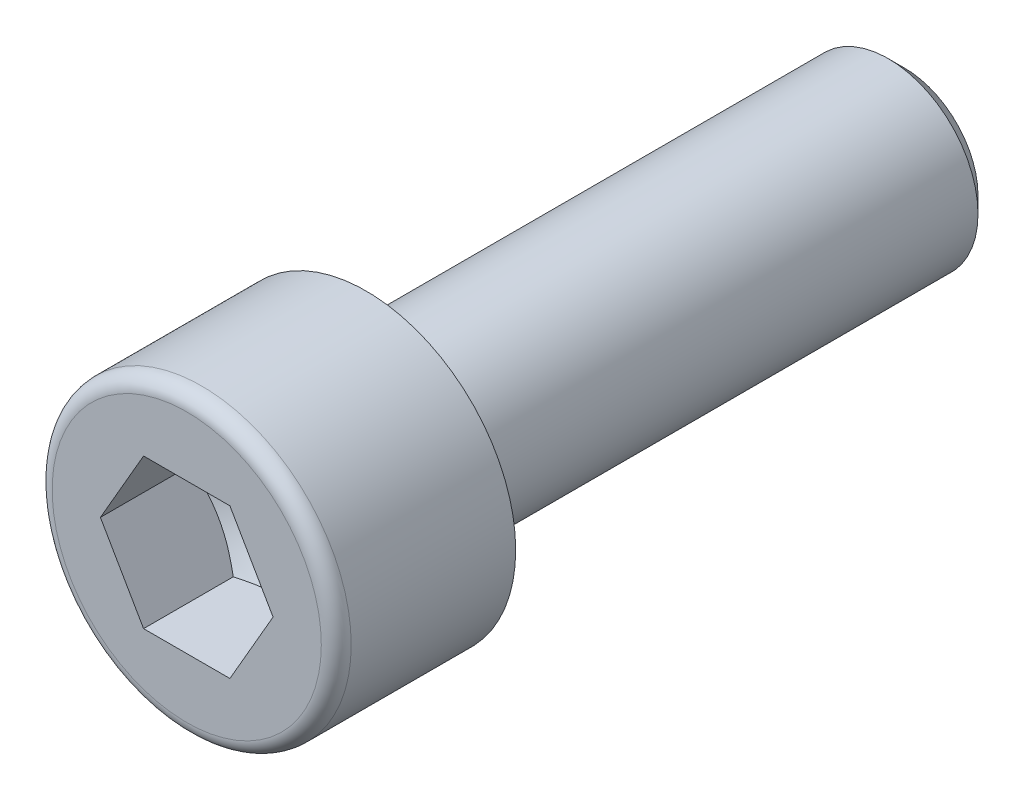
ISO-10303-21;
HEADER;
FILE_DESCRIPTION(('STEP AP214'),'2;1');
FILE_NAME('part.step','',(''),(''),'','','');
FILE_SCHEMA(('AUTOMOTIVE_DESIGN { 1 0 10303 214 1 1 1 1 }'));
ENDSEC;
DATA;
#1=APPLICATION_CONTEXT('core data for automotive mechanical design processes');
#2=APPLICATION_PROTOCOL_DEFINITION('international standard','automotive_design',2000,#1);
#3=PRODUCT_CONTEXT('',#1,'mechanical');
#4=PRODUCT('Part','Part','',(#3));
#5=PRODUCT_RELATED_PRODUCT_CATEGORY('part','',(#4));
#6=PRODUCT_DEFINITION_FORMATION('','',#4);
#7=PRODUCT_DEFINITION_CONTEXT('part definition',#1,'design');
#8=PRODUCT_DEFINITION('design','',#6,#7);
#9=PRODUCT_DEFINITION_SHAPE('','',#8);
#10=(LENGTH_UNIT() NAMED_UNIT(*) SI_UNIT(.MILLI.,.METRE.));
#11=(NAMED_UNIT(*) PLANE_ANGLE_UNIT() SI_UNIT($,.RADIAN.));
#12=(NAMED_UNIT(*) SI_UNIT($,.STERADIAN.) SOLID_ANGLE_UNIT());
#13=UNCERTAINTY_MEASURE_WITH_UNIT(LENGTH_MEASURE(1.E-05),#10,'distance_accuracy_value','');
#14=(GEOMETRIC_REPRESENTATION_CONTEXT(3) GLOBAL_UNCERTAINTY_ASSIGNED_CONTEXT((#13)) GLOBAL_UNIT_ASSIGNED_CONTEXT((#10,
#11,#12)) REPRESENTATION_CONTEXT('',''));
#15=CARTESIAN_POINT('',(0.,0.,0.));
#16=DIRECTION('',(0.,0.,1.));
#17=DIRECTION('',(1.,0.,0.));
#18=AXIS2_PLACEMENT_3D('',#15,#16,#17);
#19=CARTESIAN_POINT('',(6.10622663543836E-13,5.55111512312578E-13,6.));
#20=DIRECTION('',(0.,0.,1.));
#21=DIRECTION('',(1.00000000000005,0.,0.));
#22=AXIS2_PLACEMENT_3D('',#19,#20,#21);
#23=PLANE('',#22);
#24=CARTESIAN_POINT('',(6.10622663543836E-13,5.55111512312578E-13,6.));
#25=DIRECTION('',(0.,0.,1.));
#26=DIRECTION('',(1.00000000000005,0.,0.));
#27=AXIS2_PLACEMENT_3D('',#24,#25,#26);
#28=CIRCLE('',#27,4.5);
#29=CARTESIAN_POINT('',(4.50000000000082,6.41292574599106E-13,6.));
#30=VERTEX_POINT('',#29);
#31=EDGE_CURVE('E13',#30,#30,#28,.T.);
#32=ORIENTED_EDGE('',*,*,#31,.T.);
#33=EDGE_LOOP('',(#32));
#34=FACE_BOUND('',#33,.T.);
#35=DIRECTION('',(1.00000000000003,0.,0.));
#36=VECTOR('',#35,1.);
#37=CARTESIAN_POINT('',(-1.44337499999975,2.49999883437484,6.00000000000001));
#38=LINE('',#37,#36);
#39=CARTESIAN_POINT('',(-1.44337499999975,2.49999883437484,6.00000000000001));
#40=VERTEX_POINT('',#39);
#41=CARTESIAN_POINT('',(1.44337500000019,2.499998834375,6.));
#42=VERTEX_POINT('',#41);
#43=EDGE_CURVE('E100',#40,#42,#38,.T.);
#44=ORIENTED_EDGE('',*,*,#43,.T.);
#45=DIRECTION('',(0.5,-0.866025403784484,0.));
#46=VECTOR('',#45,1.);
#47=CARTESIAN_POINT('',(1.44337500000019,2.499998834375,6.));
#48=LINE('',#47,#46);
#49=CARTESIAN_POINT('',(2.88674999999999,0.,5.99999999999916));
#50=VERTEX_POINT('',#49);
#51=EDGE_CURVE('E39',#42,#50,#48,.T.);
#52=ORIENTED_EDGE('',*,*,#51,.T.);
#53=DIRECTION('',(-0.500000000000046,-0.866025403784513,0.));
#54=VECTOR('',#53,1.);
#55=CARTESIAN_POINT('',(2.88674999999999,0.,5.99999999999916));
#56=LINE('',#55,#54);
#57=CARTESIAN_POINT('',(1.44337500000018,-2.49999883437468,5.99999999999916));
#58=VERTEX_POINT('',#57);
#59=EDGE_CURVE('E177',#50,#58,#56,.T.);
#60=ORIENTED_EDGE('',*,*,#59,.T.);
#61=DIRECTION('',(-1.00000000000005,0.,0.));
#62=VECTOR('',#61,1.);
#63=CARTESIAN_POINT('',(1.44337500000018,-2.49999883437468,5.99999999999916));
#64=LINE('',#63,#62);
#65=CARTESIAN_POINT('',(-1.44337499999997,-2.49999883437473,6.));
#66=VERTEX_POINT('',#65);
#67=EDGE_CURVE('E173',#58,#66,#64,.T.);
#68=ORIENTED_EDGE('',*,*,#67,.T.);
#69=DIRECTION('',(-0.5,0.866025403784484,0.));
#70=VECTOR('',#69,1.);
#71=CARTESIAN_POINT('',(-1.44337499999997,-2.49999883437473,6.));
#72=LINE('',#71,#70);
#73=CARTESIAN_POINT('',(-2.88674999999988,1.11022302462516E-13,6.));
#74=VERTEX_POINT('',#73);
#75=EDGE_CURVE('E168',#66,#74,#72,.T.);
#76=ORIENTED_EDGE('',*,*,#75,.T.);
#77=DIRECTION('',(0.500000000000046,0.866025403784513,0.));
#78=VECTOR('',#77,1.);
#79=CARTESIAN_POINT('',(-2.88674999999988,1.11022302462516E-13,6.));
#80=LINE('',#79,#78);
#81=EDGE_CURVE('E104',#74,#40,#80,.T.);
#82=ORIENTED_EDGE('',*,*,#81,.T.);
#83=EDGE_LOOP('',(#44,#52,#60,#68,#76,#82));
#84=FACE_BOUND('',#83,.T.);
#85=ADVANCED_FACE('F25',(#34,#84),#23,.T.);
#86=CARTESIAN_POINT('',(0.,1.11022302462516E-13,5.5));
#87=DIRECTION('',(0.,0.,1.));
#88=DIRECTION('',(1.00000000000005,0.,0.));
#89=AXIS2_PLACEMENT_3D('',#86,#87,#88);
#90=TOROIDAL_SURFACE('',#89,4.5,0.5);
#91=ORIENTED_EDGE('',*,*,#31,.F.);
#92=EDGE_LOOP('',(#91));
#93=FACE_BOUND('',#92,.T.);
#94=CARTESIAN_POINT('',(0.,1.11022302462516E-13,5.5));
#95=DIRECTION('',(0.,0.,1.));
#96=DIRECTION('',(1.00000000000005,0.,0.));
#97=AXIS2_PLACEMENT_3D('',#94,#95,#96);
#98=CIRCLE('',#97,5.);
#99=CARTESIAN_POINT('',(5.00000000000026,2.06779038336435E-13,5.5));
#100=VERTEX_POINT('',#99);
#101=EDGE_CURVE('E32',#100,#100,#98,.T.);
#102=ORIENTED_EDGE('',*,*,#101,.T.);
#103=EDGE_LOOP('',(#102));
#104=FACE_BOUND('',#103,.T.);
#105=ADVANCED_FACE('F141',(#93,#104),#90,.T.);
#106=CARTESIAN_POINT('',(6.10622663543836E-13,5.55111512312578E-13,6.));
#107=DIRECTION('',(0.,0.,1.));
#108=DIRECTION('',(1.00000000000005,0.,0.));
#109=AXIS2_PLACEMENT_3D('',#106,#107,#108);
#110=CYLINDRICAL_SURFACE('',#109,5.);
#111=CARTESIAN_POINT('',(0.,0.,0.));
#112=DIRECTION('',(0.,0.,1.));
#113=DIRECTION('',(1.00000000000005,0.,0.));
#114=AXIS2_PLACEMENT_3D('',#111,#112,#113);
#115=CIRCLE('',#114,5.);
#116=CARTESIAN_POINT('',(5.00000000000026,0.,0.));
#117=VERTEX_POINT('',#116);
#118=EDGE_CURVE('E136',#117,#117,#115,.T.);
#119=ORIENTED_EDGE('',*,*,#118,.T.);
#120=EDGE_LOOP('',(#119));
#121=FACE_BOUND('',#120,.T.);
#122=ORIENTED_EDGE('',*,*,#101,.F.);
#123=EDGE_LOOP('',(#122));
#124=FACE_BOUND('',#123,.T.);
#125=ADVANCED_FACE('F143',(#121,#124),#110,.T.);
#126=CARTESIAN_POINT('',(0.,5.,0.));
#127=DIRECTION('',(0.,0.,-1.));
#128=DIRECTION('',(-1.00000000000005,0.,0.));
#129=AXIS2_PLACEMENT_3D('',#126,#127,#128);
#130=PLANE('',#129);
#131=CARTESIAN_POINT('',(0.,0.,0.));
#132=DIRECTION('',(0.,0.,1.));
#133=DIRECTION('',(1.00000000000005,0.,0.));
#134=AXIS2_PLACEMENT_3D('',#131,#132,#133);
#135=CIRCLE('',#134,3.3);
#136=CARTESIAN_POINT('',(3.30000000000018,0.,0.));
#137=VERTEX_POINT('',#136);
#138=EDGE_CURVE('E133',#137,#137,#135,.T.);
#139=ORIENTED_EDGE('',*,*,#138,.T.);
#140=EDGE_LOOP('',(#139));
#141=FACE_BOUND('',#140,.T.);
#142=ORIENTED_EDGE('',*,*,#118,.F.);
#143=EDGE_LOOP('',(#142));
#144=FACE_BOUND('',#143,.T.);
#145=ADVANCED_FACE('F145',(#141,#144),#130,.T.);
#146=CARTESIAN_POINT('',(0.,0.,-0.300000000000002));
#147=DIRECTION('',(0.,0.,1.));
#148=DIRECTION('',(1.00000000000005,0.,0.));
#149=AXIS2_PLACEMENT_3D('',#146,#147,#148);
#150=TOROIDAL_SURFACE('',#149,3.3,0.3);
#151=CARTESIAN_POINT('',(0.,0.,-0.300000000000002));
#152=DIRECTION('',(0.,0.,1.));
#153=DIRECTION('',(1.00000000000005,0.,0.));
#154=AXIS2_PLACEMENT_3D('',#151,#152,#153);
#155=CIRCLE('',#154,3.);
#156=CARTESIAN_POINT('',(3.00000000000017,0.,-0.300000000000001));
#157=VERTEX_POINT('',#156);
#158=EDGE_CURVE('E130',#157,#157,#155,.T.);
#159=ORIENTED_EDGE('',*,*,#158,.T.);
#160=EDGE_LOOP('',(#159));
#161=FACE_BOUND('',#160,.T.);
#162=ORIENTED_EDGE('',*,*,#138,.F.);
#163=EDGE_LOOP('',(#162));
#164=FACE_BOUND('',#163,.T.);
#165=ADVANCED_FACE('F153',(#161,#164),#150,.F.);
#166=CARTESIAN_POINT('',(6.10622663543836E-13,5.55111512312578E-13,6.));
#167=DIRECTION('',(0.,0.,1.));
#168=DIRECTION('',(1.00000000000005,0.,0.));
#169=AXIS2_PLACEMENT_3D('',#166,#167,#168);
#170=CYLINDRICAL_SURFACE('',#169,3.);
#171=CARTESIAN_POINT('',(0.,0.,-0.301000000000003));
#172=DIRECTION('',(0.,0.,1.));
#173=DIRECTION('',(1.00000000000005,0.,0.));
#174=AXIS2_PLACEMENT_3D('',#171,#172,#173);
#175=CIRCLE('',#174,3.);
#176=CARTESIAN_POINT('',(3.00000000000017,0.,-0.301000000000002));
#177=VERTEX_POINT('',#176);
#178=EDGE_CURVE('E127',#177,#177,#175,.T.);
#179=ORIENTED_EDGE('',*,*,#178,.T.);
#180=EDGE_LOOP('',(#179));
#181=FACE_BOUND('',#180,.T.);
#182=ORIENTED_EDGE('',*,*,#158,.F.);
#183=EDGE_LOOP('',(#182));
#184=FACE_BOUND('',#183,.T.);
#185=ADVANCED_FACE('F276',(#181,#184),#170,.T.);
#186=CARTESIAN_POINT('',(0.,0.,-0.301000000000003));
#187=DIRECTION('',(0.,0.,1.));
#188=DIRECTION('',(1.00000000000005,0.,0.));
#189=AXIS2_PLACEMENT_3D('',#186,#187,#188);
#190=CONICAL_SURFACE('',#189,3.,0.523598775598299);
#191=CARTESIAN_POINT('',(3.05311331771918E-13,0.,-1.23847249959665));
#192=DIRECTION('',(0.,0.,1.));
#193=DIRECTION('',(1.00000000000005,0.,0.));
#194=AXIS2_PLACEMENT_3D('',#191,#192,#193);
#195=CIRCLE('',#194,2.45875);
#196=CARTESIAN_POINT('',(2.45875000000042,0.,-1.23847249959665));
#197=VERTEX_POINT('',#196);
#198=EDGE_CURVE('E124',#197,#197,#195,.T.);
#199=ORIENTED_EDGE('',*,*,#198,.T.);
#200=EDGE_LOOP('',(#199));
#201=FACE_BOUND('',#200,.T.);
#202=ORIENTED_EDGE('',*,*,#178,.F.);
#203=EDGE_LOOP('',(#202));
#204=FACE_BOUND('',#203,.T.);
#205=ADVANCED_FACE('F272',(#201,#204),#190,.T.);
#206=CARTESIAN_POINT('',(3.05311331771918E-13,2.45875000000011,-1.23847249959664));
#207=DIRECTION('',(0.,0.,1.));
#208=DIRECTION('',(1.00000000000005,0.,0.));
#209=AXIS2_PLACEMENT_3D('',#206,#207,#208);
#210=PLANE('',#209);
#211=CARTESIAN_POINT('',(3.05311331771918E-13,0.,-1.23847249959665));
#212=DIRECTION('',(0.,0.,1.));
#213=DIRECTION('',(1.00000000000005,0.,0.));
#214=AXIS2_PLACEMENT_3D('',#211,#212,#213);
#215=CIRCLE('',#214,3.);
#216=CARTESIAN_POINT('',(3.00000000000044,0.,-1.23847249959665));
#217=VERTEX_POINT('',#216);
#218=EDGE_CURVE('E121',#217,#217,#215,.T.);
#219=ORIENTED_EDGE('',*,*,#218,.T.);
#220=EDGE_LOOP('',(#219));
#221=FACE_BOUND('',#220,.T.);
#222=ORIENTED_EDGE('',*,*,#198,.F.);
#223=EDGE_LOOP('',(#222));
#224=FACE_BOUND('',#223,.T.);
#225=ADVANCED_FACE('F268',(#221,#224),#210,.T.);
#226=CARTESIAN_POINT('',(6.10622663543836E-13,5.55111512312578E-13,6.));
#227=DIRECTION('',(0.,0.,1.));
#228=DIRECTION('',(1.00000000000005,0.,0.));
#229=AXIS2_PLACEMENT_3D('',#226,#227,#228);
#230=CYLINDRICAL_SURFACE('',#229,3.);
#231=CARTESIAN_POINT('',(5.82867087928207E-13,0.,-17.45875));
#232=DIRECTION('',(0.,0.,1.));
#233=DIRECTION('',(1.00000000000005,0.,0.));
#234=AXIS2_PLACEMENT_3D('',#231,#232,#233);
#235=CIRCLE('',#234,3.);
#236=CARTESIAN_POINT('',(3.00000000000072,0.,-17.45875));
#237=VERTEX_POINT('',#236);
#238=EDGE_CURVE('E118',#237,#237,#235,.T.);
#239=ORIENTED_EDGE('',*,*,#238,.T.);
#240=EDGE_LOOP('',(#239));
#241=FACE_BOUND('',#240,.T.);
#242=ORIENTED_EDGE('',*,*,#218,.F.);
#243=EDGE_LOOP('',(#242));
#244=FACE_BOUND('',#243,.T.);
#245=ADVANCED_FACE('F261',(#241,#244),#230,.T.);
#246=CARTESIAN_POINT('',(5.82867087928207E-13,0.,-17.45875));
#247=DIRECTION('',(0.,0.,1.));
#248=DIRECTION('',(1.00000000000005,0.,0.));
#249=AXIS2_PLACEMENT_3D('',#246,#247,#248);
#250=CONICAL_SURFACE('',#249,3.,0.78539816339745);
#251=CARTESIAN_POINT('',(3.60822483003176E-13,0.,-18.));
#252=DIRECTION('',(0.,0.,1.));
#253=DIRECTION('',(1.00000000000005,0.,0.));
#254=AXIS2_PLACEMENT_3D('',#251,#252,#253);
#255=CIRCLE('',#254,2.45875);
#256=CARTESIAN_POINT('',(2.45875000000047,0.,-18.));
#257=VERTEX_POINT('',#256);
#258=EDGE_CURVE('E115',#257,#257,#255,.T.);
#259=ORIENTED_EDGE('',*,*,#258,.T.);
#260=EDGE_LOOP('',(#259));
#261=FACE_BOUND('',#260,.T.);
#262=ORIENTED_EDGE('',*,*,#238,.F.);
#263=EDGE_LOOP('',(#262));
#264=FACE_BOUND('',#263,.T.);
#265=ADVANCED_FACE('F256',(#261,#264),#250,.T.);
#266=CARTESIAN_POINT('',(3.60822483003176E-13,2.4587500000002,-18.));
#267=DIRECTION('',(0.,0.,-1.));
#268=DIRECTION('',(-1.00000000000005,0.,0.));
#269=AXIS2_PLACEMENT_3D('',#266,#267,#268);
#270=PLANE('',#269);
#271=ORIENTED_EDGE('',*,*,#258,.F.);
#272=EDGE_LOOP('',(#271));
#273=FACE_BOUND('',#272,.T.);
#274=ADVANCED_FACE('F233',(#273),#270,.T.);
#275=CARTESIAN_POINT('',(1.4433750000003,2.49999883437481,1.33333411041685));
#276=DIRECTION('',(-0.866025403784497,-0.500000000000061,0.));
#277=DIRECTION('',(-0.5,0.866025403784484,0.));
#278=AXIS2_PLACEMENT_3D('',#275,#276,#277);
#279=PLANE('',#278);
#280=DIRECTION('',(0.,0.,1.));
#281=VECTOR('',#280,1.);
#282=CARTESIAN_POINT('',(2.88675000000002,0.,1.333334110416));
#283=LINE('',#282,#281);
#284=CARTESIAN_POINT('',(2.88675000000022,1.66533453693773E-13,2.99999999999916));
#285=VERTEX_POINT('',#284);
#286=EDGE_CURVE('E113',#285,#50,#283,.T.);
#287=ORIENTED_EDGE('',*,*,#286,.T.);
#288=ORIENTED_EDGE('',*,*,#51,.F.);
#289=DIRECTION('',(0.,0.,1.));
#290=VECTOR('',#289,1.);
#291=CARTESIAN_POINT('',(1.4433750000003,2.49999883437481,1.33333411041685));
#292=LINE('',#291,#290);
#293=CARTESIAN_POINT('',(1.44337500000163,2.49999883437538,3.));
#294=VERTEX_POINT('',#293);
#295=EDGE_CURVE('E94',#294,#42,#292,.T.);
#296=ORIENTED_EDGE('',*,*,#295,.F.);
#297=CARTESIAN_POINT('',(2.88675011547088,-1.99999558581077E-07,3.00000006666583));
#298=CARTESIAN_POINT('',(2.82332252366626,0.109859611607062,2.96336950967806));
#299=CARTESIAN_POINT('',(2.75934742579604,0.220667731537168,2.93005593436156));
#300=CARTESIAN_POINT('',(2.63028954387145,0.444202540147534,2.87190808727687));
#301=CARTESIAN_POINT('',(2.56520446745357,0.556933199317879,2.84709438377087));
#302=CARTESIAN_POINT('',(2.43584088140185,0.780997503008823,2.80847006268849));
#303=CARTESIAN_POINT('',(2.37158227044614,0.892296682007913,2.7944023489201));
#304=CARTESIAN_POINT('',(2.24276284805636,1.1154184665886,2.77761157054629));
#305=CARTESIAN_POINT('',(2.17820250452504,1.22724026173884,2.77487459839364));
#306=CARTESIAN_POINT('',(2.05757841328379,1.43616731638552,2.78058295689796));
#307=CARTESIAN_POINT('',(2.00149656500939,1.53330392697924,2.78762669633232));
#308=CARTESIAN_POINT('',(1.88969822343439,1.72694433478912,2.8099467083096));
#309=CARTESIAN_POINT('',(1.83398211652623,1.82344746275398,2.8252305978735));
#310=CARTESIAN_POINT('',(1.7219534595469,2.01748678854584,2.86343736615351));
#311=CARTESIAN_POINT('',(1.6656550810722,2.11499844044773,2.88652212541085));
#312=CARTESIAN_POINT('',(1.55389777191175,2.3085677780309,2.93891477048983));
#313=CARTESIAN_POINT('',(1.4984374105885,2.40462794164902,2.96821035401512));
#314=CARTESIAN_POINT('',(1.44337488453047,2.49999903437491,3.00000006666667));
#315=B_SPLINE_CURVE_WITH_KNOTS('',3,(#297,#298,#299,#300,#301,#302,#303,#304,#305,#306,#307,
#308,#309,#310,#311,#312,#313,#314),.UNSPECIFIED.,.F.,.F.,(4,2,2,2,2,2,2,2,4),(0.,
0.396269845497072,0.793491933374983,1.18088400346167,1.56780044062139,1.90463400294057,
2.24177946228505,2.58640119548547,2.93034658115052),.UNSPECIFIED.);
#316=EDGE_CURVE('E87',#285,#294,#315,.T.);
#317=ORIENTED_EDGE('',*,*,#316,.F.);
#318=EDGE_LOOP('',(#287,#288,#296,#317));
#319=FACE_BOUND('',#318,.T.);
#320=ADVANCED_FACE('F95',(#319),#279,.T.);
#321=CARTESIAN_POINT('',(2.88675000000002,0.,1.333334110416));
#322=DIRECTION('',(-0.866025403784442,0.500000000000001,0.));
#323=DIRECTION('',(0.500000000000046,0.866025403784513,0.));
#324=AXIS2_PLACEMENT_3D('',#321,#322,#323);
#325=PLANE('',#324);
#326=DIRECTION('',(0.,0.,1.));
#327=VECTOR('',#326,1.);
#328=CARTESIAN_POINT('',(1.44337500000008,-2.49999883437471,1.333334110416));
#329=LINE('',#328,#327);
#330=CARTESIAN_POINT('',(1.44337500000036,-2.4999988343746,2.99999999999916));
#331=VERTEX_POINT('',#330);
#332=EDGE_CURVE('E111',#331,#58,#329,.T.);
#333=ORIENTED_EDGE('',*,*,#332,.T.);
#334=ORIENTED_EDGE('',*,*,#59,.F.);
#335=ORIENTED_EDGE('',*,*,#286,.F.);
#336=CARTESIAN_POINT('',(1.44337488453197,-2.49999903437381,3.00000006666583));
#337=CARTESIAN_POINT('',(1.50680247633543,-2.39013922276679,2.96336950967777));
#338=CARTESIAN_POINT('',(1.57077757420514,-2.27933110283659,2.93005593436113));
#339=CARTESIAN_POINT('',(1.69983545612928,-2.05579629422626,2.87190808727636));
#340=CARTESIAN_POINT('',(1.76492053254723,-1.94306563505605,2.84709438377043));
#341=CARTESIAN_POINT('',(1.89428411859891,-1.71900133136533,2.80847006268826));
#342=CARTESIAN_POINT('',(1.95854272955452,-1.60770215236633,2.79440234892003));
#343=CARTESIAN_POINT('',(2.08736215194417,-1.38458036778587,2.77761157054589));
#344=CARTESIAN_POINT('',(2.15192249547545,-1.27275857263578,2.77487459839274));
#345=CARTESIAN_POINT('',(2.27254658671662,-1.06383151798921,2.78058295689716));
#346=CARTESIAN_POINT('',(2.328628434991,-0.966694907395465,2.78762669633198));
#347=CARTESIAN_POINT('',(2.44042677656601,-0.773054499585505,2.80994670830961));
#348=CARTESIAN_POINT('',(2.49614288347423,-0.676551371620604,2.82523059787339));
#349=CARTESIAN_POINT('',(2.60817154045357,-0.482512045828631,2.86343736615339));
#350=CARTESIAN_POINT('',(2.66446991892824,-0.38500039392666,2.88652212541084));
#351=CARTESIAN_POINT('',(2.77622722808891,-0.191431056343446,2.93891477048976));
#352=CARTESIAN_POINT('',(2.83168758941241,-0.0953708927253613,2.96821035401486));
#353=CARTESIAN_POINT('',(2.88675011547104,2.00000391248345E-07,3.00000006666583));
#354=B_SPLINE_CURVE_WITH_KNOTS('',3,(#336,#337,#338,#339,#340,#341,#342,#343,#344,#345,#346,
#347,#348,#349,#350,#351,#352,#353),.UNSPECIFIED.,.F.,.F.,(4,2,2,2,2,2,2,2,4),(0.,
0.396269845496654,0.793491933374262,1.18088400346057,1.56780044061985,1.90463400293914,
2.24177946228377,2.58640119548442,2.93034658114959),.UNSPECIFIED.);
#355=EDGE_CURVE('E91',#331,#285,#354,.T.);
#356=ORIENTED_EDGE('',*,*,#355,.F.);
#357=EDGE_LOOP('',(#333,#334,#335,#356));
#358=FACE_BOUND('',#357,.T.);
#359=ADVANCED_FACE('F224',(#358),#325,.T.);
#360=CARTESIAN_POINT('',(1.44337500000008,-2.49999883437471,1.333334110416));
#361=DIRECTION('',(0.,1.00000000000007,0.));
#362=DIRECTION('',(1.00000000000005,0.,0.));
#363=AXIS2_PLACEMENT_3D('',#360,#361,#362);
#364=PLANE('',#363);
#365=DIRECTION('',(0.,0.,1.));
#366=VECTOR('',#365,1.);
#367=CARTESIAN_POINT('',(-1.443375,-2.49999883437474,1.33333411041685));
#368=LINE('',#367,#366);
#369=CARTESIAN_POINT('',(-1.44337499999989,-2.4999988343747,3.));
#370=VERTEX_POINT('',#369);
#371=EDGE_CURVE('E109',#370,#66,#368,.T.);
#372=ORIENTED_EDGE('',*,*,#371,.T.);
#373=ORIENTED_EDGE('',*,*,#67,.F.);
#374=ORIENTED_EDGE('',*,*,#332,.F.);
#375=CARTESIAN_POINT('',(-3.73786106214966,-2.49999883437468,3.92958778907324));
#376=CARTESIAN_POINT('',(-3.62990250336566,-2.49999883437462,3.87779335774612));
#377=CARTESIAN_POINT('',(-3.52168094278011,-2.49999883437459,3.82653690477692));
#378=CARTESIAN_POINT('',(-3.30457164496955,-2.49999883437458,3.72540514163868));
#379=CARTESIAN_POINT('',(-3.19568379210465,-2.49999883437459,3.67553008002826));
#380=CARTESIAN_POINT('',(-2.97647740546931,-2.4999988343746,3.57718765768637));
#381=CARTESIAN_POINT('',(-2.8661541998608,-2.4999988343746,3.5287306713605));
#382=CARTESIAN_POINT('',(-2.64458202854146,-2.4999988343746,3.43398963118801));
#383=CARTESIAN_POINT('',(-2.53333311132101,-2.49999883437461,3.38770546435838));
#384=CARTESIAN_POINT('',(-2.30680205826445,-2.49999883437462,3.29671007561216));
#385=CARTESIAN_POINT('',(-2.19149052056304,-2.49999883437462,3.25207161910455));
#386=CARTESIAN_POINT('',(-1.95947266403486,-2.49999883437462,3.16650598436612));
#387=CARTESIAN_POINT('',(-1.84276618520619,-2.49999883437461,3.12557923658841));
#388=CARTESIAN_POINT('',(-1.60804233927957,-2.49999883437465,3.04860739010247));
#389=CARTESIAN_POINT('',(-1.49002871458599,-2.49999883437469,3.01255100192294));
#390=CARTESIAN_POINT('',(-1.252310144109,-2.49999883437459,2.94655294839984));
#391=CARTESIAN_POINT('',(-1.13260562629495,-2.49999883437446,2.91660976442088));
#392=CARTESIAN_POINT('',(-0.891754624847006,-2.49999883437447,2.8644343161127));
#393=CARTESIAN_POINT('',(-0.770611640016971,-2.49999883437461,2.84218621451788));
#394=CARTESIAN_POINT('',(-0.526970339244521,-2.4999988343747,2.80685777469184));
#395=CARTESIAN_POINT('',(-0.40447211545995,-2.49999883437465,2.79377681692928));
#396=CARTESIAN_POINT('',(-0.160266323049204,-2.49999883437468,2.7779963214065));
#397=CARTESIAN_POINT('',(-0.0385668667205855,-2.49999883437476,2.77517427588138));
#398=CARTESIAN_POINT('',(0.204641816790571,-2.4999988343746,2.77983589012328));
#399=CARTESIAN_POINT('',(0.326151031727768,-2.49999883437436,2.78732018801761));
#400=CARTESIAN_POINT('',(0.536550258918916,-2.49999883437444,2.8086987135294));
#401=CARTESIAN_POINT('',(0.625672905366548,-2.49999883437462,2.82040889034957));
#402=CARTESIAN_POINT('',(0.803172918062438,-2.49999883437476,2.8485682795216));
#403=CARTESIAN_POINT('',(0.891550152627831,-2.49999883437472,2.86501831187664));
#404=CARTESIAN_POINT('',(1.15551819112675,-2.49999883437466,2.92060817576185));
#405=CARTESIAN_POINT('',(1.32980784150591,-2.4999988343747,2.96597208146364));
#406=CARTESIAN_POINT('',(1.59042319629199,-2.49999883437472,3.0434740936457));
#407=CARTESIAN_POINT('',(1.67812270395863,-2.49999883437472,3.07124565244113));
#408=CARTESIAN_POINT('',(1.85261386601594,-2.49999883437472,3.12935698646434));
#409=CARTESIAN_POINT('',(1.93940604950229,-2.49999883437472,3.15969515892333));
#410=CARTESIAN_POINT('',(2.1121920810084,-2.49999883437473,3.22250012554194));
#411=CARTESIAN_POINT('',(2.19818607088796,-2.49999883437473,3.2549665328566));
#412=CARTESIAN_POINT('',(2.36949689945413,-2.49999883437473,3.32167630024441));
#413=CARTESIAN_POINT('',(2.45481362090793,-2.49999883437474,3.35591996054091));
#414=CARTESIAN_POINT('',(2.67258663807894,-2.49999883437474,3.44552247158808));
#415=CARTESIAN_POINT('',(2.8046071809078,-2.49999883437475,3.50193902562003));
#416=CARTESIAN_POINT('',(3.06745885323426,-2.49999883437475,3.61748625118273));
#417=CARTESIAN_POINT('',(3.19828989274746,-2.49999883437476,3.67661712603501));
#418=CARTESIAN_POINT('',(3.45900849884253,-2.49999883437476,3.79697660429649));
#419=CARTESIAN_POINT('',(3.5888958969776,-2.49999883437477,3.85820557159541));
#420=CARTESIAN_POINT('',(3.84788845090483,-2.49999883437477,3.98229868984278));
#421=CARTESIAN_POINT('',(3.97699358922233,-2.49999883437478,4.04516287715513));
#422=CARTESIAN_POINT('',(4.36366789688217,-2.49999883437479,4.23583162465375));
#423=CARTESIAN_POINT('',(4.62028438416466,-2.49999883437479,4.36556637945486));
#424=CARTESIAN_POINT('',(5.13176032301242,-2.49999883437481,4.62835381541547));
#425=CARTESIAN_POINT('',(5.38661999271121,-2.49999883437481,4.76140607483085));
#426=CARTESIAN_POINT('',(5.87112445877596,-2.49999883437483,5.0171462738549));
#427=CARTESIAN_POINT('',(6.10087872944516,-2.49999883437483,5.13962714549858));
#428=CARTESIAN_POINT('',(6.55964828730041,-2.49999883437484,5.38598335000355));
#429=CARTESIAN_POINT('',(6.788663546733,-2.49999883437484,5.50985873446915));
#430=CARTESIAN_POINT('',(7.2455428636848,-2.49999883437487,5.75833893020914));
#431=CARTESIAN_POINT('',(7.47340836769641,-2.49999883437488,5.88294108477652));
#432=CARTESIAN_POINT('',(7.92867868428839,-2.49999883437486,6.1329563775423));
#433=CARTESIAN_POINT('',(8.15608352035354,-2.49999883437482,6.25836947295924));
#434=CARTESIAN_POINT('',(8.38332285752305,-2.49999883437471,6.38407980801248));
#435=B_SPLINE_CURVE_WITH_KNOTS('',3,(#375,#376,#377,#378,#379,#380,#381,#382,#383,#384,#385,
#386,#387,#388,#389,#390,#391,#392,#393,#394,#395,#396,#397,#398,#399,#400,#401,#402,#403,#404,
#405,#406,#407,#408,#409,#410,#411,#412,#413,#414,#415,#416,#417,#418,#419,#420,#421,#422,#423,
#424,#425,#426,#427,#428,#429,#430,#431,#432,#433,#434),.UNSPECIFIED.,.F.,.F.,(4,2,2,2,2,2,2,2,
2,2,2,2,2,2,2,2,2,2,2,2,2,2,2,2,2,2,2,2,2,4),(0.,0.359225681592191,0.718515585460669,
1.07998495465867,1.44143550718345,1.81233642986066,2.18328031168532,2.55334902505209,
2.9233256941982,3.29253631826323,3.66172198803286,4.02648423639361,4.39126907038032,
4.66080188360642,4.93038135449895,5.46995360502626,5.74590907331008,6.02169347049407,
6.29742787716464,6.57320901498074,7.00387398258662,7.43457126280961,7.86534362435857,
8.29612557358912,9.15872149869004,10.0212083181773,10.8022890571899,11.583398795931,
12.3625217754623,13.1416039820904),.UNSPECIFIED.);
#436=EDGE_CURVE('E215',#370,#331,#435,.T.);
#437=ORIENTED_EDGE('',*,*,#436,.F.);
#438=EDGE_LOOP('',(#372,#373,#374,#437));
#439=FACE_BOUND('',#438,.T.);
#440=ADVANCED_FACE('F220',(#439),#364,.T.);
#441=CARTESIAN_POINT('',(-1.443375,-2.49999883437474,1.33333411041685));
#442=DIRECTION('',(0.866025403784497,0.500000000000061,0.));
#443=DIRECTION('',(0.5,-0.866025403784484,0.));
#444=AXIS2_PLACEMENT_3D('',#441,#442,#443);
#445=PLANE('',#444);
#446=DIRECTION('',(0.,0.,1.));
#447=VECTOR('',#446,1.);
#448=CARTESIAN_POINT('',(-2.88674999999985,1.38777878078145E-13,1.33333411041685));
#449=LINE('',#448,#447);
#450=CARTESIAN_POINT('',(-2.88674999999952,2.77555756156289E-13,3.));
#451=VERTEX_POINT('',#450);
#452=EDGE_CURVE('E102',#451,#74,#449,.T.);
#453=ORIENTED_EDGE('',*,*,#452,.T.);
#454=ORIENTED_EDGE('',*,*,#75,.F.);
#455=ORIENTED_EDGE('',*,*,#371,.F.);
#456=CARTESIAN_POINT('',(-2.88675011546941,2.00000321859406E-07,3.00000006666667));
#457=CARTESIAN_POINT('',(-2.82332252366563,-0.109859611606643,2.96336950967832));
#458=CARTESIAN_POINT('',(-2.75934742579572,-0.220667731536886,2.93005593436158));
#459=CARTESIAN_POINT('',(-2.63028954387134,-0.444202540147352,2.87190808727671));
#460=CARTESIAN_POINT('',(-2.56520446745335,-0.55693319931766,2.84709438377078));
#461=CARTESIAN_POINT('',(-2.43584088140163,-0.780997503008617,2.8084700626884));
#462=CARTESIAN_POINT('',(-2.37158227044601,-0.892296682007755,2.79440234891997));
#463=CARTESIAN_POINT('',(-2.24276284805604,-1.11541846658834,2.77761157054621));
#464=CARTESIAN_POINT('',(-2.17820250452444,-1.22724026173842,2.77487459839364));
#465=CARTESIAN_POINT('',(-2.05757841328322,-1.43616731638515,2.78058295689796));
#466=CARTESIAN_POINT('',(-2.00149656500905,-1.53330392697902,2.78762669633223));
#467=CARTESIAN_POINT('',(-1.88969822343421,-1.72694433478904,2.80994670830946));
#468=CARTESIAN_POINT('',(-1.83398211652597,-1.82344746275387,2.82523059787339));
#469=CARTESIAN_POINT('',(-1.7219534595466,-2.01748678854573,2.86343736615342));
#470=CARTESIAN_POINT('',(-1.66565508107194,-2.11499844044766,2.88652212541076));
#471=CARTESIAN_POINT('',(-1.5538977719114,-2.30856777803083,2.93891477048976));
#472=CARTESIAN_POINT('',(-1.49843741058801,-2.4046279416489,2.96821035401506));
#473=CARTESIAN_POINT('',(-1.44337488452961,-2.49999903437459,3.00000006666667));
#474=B_SPLINE_CURVE_WITH_KNOTS('',3,(#456,#457,#458,#459,#460,#461,#462,#463,#464,#465,#466,
#467,#468,#469,#470,#471,#472,#473),.UNSPECIFIED.,.F.,.F.,(4,2,2,2,2,2,2,2,4),(0.,
0.396269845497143,0.793491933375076,1.18088400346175,1.56780044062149,1.90463400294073,
2.24177946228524,2.58640119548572,2.93034658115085),.UNSPECIFIED.);
#475=EDGE_CURVE('E210',#451,#370,#474,.T.);
#476=ORIENTED_EDGE('',*,*,#475,.F.);
#477=EDGE_LOOP('',(#453,#454,#455,#476));
#478=FACE_BOUND('',#477,.T.);
#479=ADVANCED_FACE('F223',(#478),#445,.T.);
#480=CARTESIAN_POINT('',(-2.88674999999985,1.38777878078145E-13,1.33333411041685));
#481=DIRECTION('',(0.866025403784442,-0.500000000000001,0.));
#482=DIRECTION('',(-0.500000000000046,-0.866025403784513,0.));
#483=AXIS2_PLACEMENT_3D('',#480,#481,#482);
#484=PLANE('',#483);
#485=DIRECTION('',(0.,0.,1.));
#486=VECTOR('',#485,1.);
#487=CARTESIAN_POINT('',(-1.443375,2.49999883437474,1.33333411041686));
#488=LINE('',#487,#486);
#489=CARTESIAN_POINT('',(-1.44337499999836,2.49999883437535,3.00000000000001));
#490=VERTEX_POINT('',#489);
#491=EDGE_CURVE('E99',#490,#40,#488,.T.);
#492=ORIENTED_EDGE('',*,*,#491,.T.);
#493=ORIENTED_EDGE('',*,*,#81,.F.);
#494=ORIENTED_EDGE('',*,*,#452,.F.);
#495=CARTESIAN_POINT('',(-1.44337488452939,2.49999903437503,3.00000006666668));
#496=CARTESIAN_POINT('',(-1.50680247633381,2.39013922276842,2.96336950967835));
#497=CARTESIAN_POINT('',(-1.57077757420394,2.27933110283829,2.93005593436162));
#498=CARTESIAN_POINT('',(-1.69983545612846,2.05579629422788,2.87190808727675));
#499=CARTESIAN_POINT('',(-1.76492053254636,1.94306563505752,2.8470943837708));
#500=CARTESIAN_POINT('',(-1.89428411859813,1.71900133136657,2.80847006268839));
#501=CARTESIAN_POINT('',(-1.95854272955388,1.6077021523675,2.79440234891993));
#502=CARTESIAN_POINT('',(-2.08736215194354,1.38458036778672,2.77761157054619));
#503=CARTESIAN_POINT('',(-2.1519224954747,1.27275857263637,2.77487459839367));
#504=CARTESIAN_POINT('',(-2.272546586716,1.06383151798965,2.78058295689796));
#505=CARTESIAN_POINT('',(-2.32862843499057,0.966694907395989,2.78762669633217));
#506=CARTESIAN_POINT('',(-2.4404267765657,0.77305449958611,2.80994670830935));
#507=CARTESIAN_POINT('',(-2.49614288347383,0.676551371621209,2.82523059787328));
#508=CARTESIAN_POINT('',(-2.60817154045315,0.48251204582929,2.86343736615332));
#509=CARTESIAN_POINT('',(-2.66446991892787,0.385000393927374,2.88652212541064));
#510=CARTESIAN_POINT('',(-2.77622722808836,0.191431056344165,2.93891477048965));
#511=CARTESIAN_POINT('',(-2.83168758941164,0.0953708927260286,2.96821035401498));
#512=CARTESIAN_POINT('',(-2.88675011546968,-1.99999863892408E-07,3.00000006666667));
#513=B_SPLINE_CURVE_WITH_KNOTS('',3,(#495,#496,#497,#498,#499,#500,#501,#502,#503,#504,#505,
#506,#507,#508,#509,#510,#511,#512),.UNSPECIFIED.,.F.,.F.,(4,2,2,2,2,2,2,2,4),(0.,
0.396269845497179,0.793491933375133,1.18088400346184,1.56780044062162,1.90463400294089,
2.24177946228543,2.58640119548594,2.93034658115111),.UNSPECIFIED.);
#514=EDGE_CURVE('E47',#490,#451,#513,.T.);
#515=ORIENTED_EDGE('',*,*,#514,.F.);
#516=EDGE_LOOP('',(#492,#493,#494,#515));
#517=FACE_BOUND('',#516,.T.);
#518=ADVANCED_FACE('F167',(#517),#484,.T.);
#519=CARTESIAN_POINT('',(-1.443375,2.49999883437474,1.33333411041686));
#520=DIRECTION('',(0.,-1.00000000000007,0.));
#521=DIRECTION('',(-1.00000000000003,0.,0.));
#522=AXIS2_PLACEMENT_3D('',#519,#520,#521);
#523=PLANE('',#522);
#524=ORIENTED_EDGE('',*,*,#295,.T.);
#525=ORIENTED_EDGE('',*,*,#43,.F.);
#526=ORIENTED_EDGE('',*,*,#491,.F.);
#527=CARTESIAN_POINT('',(-3.73786106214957,2.49999883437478,3.92958778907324));
#528=CARTESIAN_POINT('',(-3.62990250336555,2.49999883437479,3.87779335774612));
#529=CARTESIAN_POINT('',(-3.52168094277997,2.49999883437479,3.82653690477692));
#530=CARTESIAN_POINT('',(-3.30457164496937,2.49999883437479,3.72540514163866));
#531=CARTESIAN_POINT('',(-3.19568379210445,2.49999883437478,3.67553008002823));
#532=CARTESIAN_POINT('',(-2.97647740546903,2.49999883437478,3.5771876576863));
#533=CARTESIAN_POINT('',(-2.86615419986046,2.49999883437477,3.52873067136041));
#534=CARTESIAN_POINT('',(-2.64458202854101,2.49999883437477,3.43398963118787));
#535=CARTESIAN_POINT('',(-2.53333311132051,2.49999883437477,3.38770546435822));
#536=CARTESIAN_POINT('',(-2.30680205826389,2.49999883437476,3.29671007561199));
#537=CARTESIAN_POINT('',(-2.19149052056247,2.49999883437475,3.2520716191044));
#538=CARTESIAN_POINT('',(-1.95947266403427,2.49999883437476,3.16650598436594));
#539=CARTESIAN_POINT('',(-1.84276618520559,2.49999883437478,3.12557923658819));
#540=CARTESIAN_POINT('',(-1.60804233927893,2.49999883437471,3.04860739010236));
#541=CARTESIAN_POINT('',(-1.49002871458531,2.49999883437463,3.012551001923));
#542=CARTESIAN_POINT('',(-1.25231014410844,2.49999883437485,2.94655294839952));
#543=CARTESIAN_POINT('',(-1.13260562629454,2.49999883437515,2.91660976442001));
#544=CARTESIAN_POINT('',(-0.891754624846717,2.49999883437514,2.86443431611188));
#545=CARTESIAN_POINT('',(-0.770611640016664,2.49999883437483,2.84218621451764));
#546=CARTESIAN_POINT('',(-0.526970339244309,2.49999883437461,2.80685777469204));
#547=CARTESIAN_POINT('',(-0.40447211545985,2.4999988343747,2.79377681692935));
#548=CARTESIAN_POINT('',(-0.160266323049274,2.49999883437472,2.77799632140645));
#549=CARTESIAN_POINT('',(-0.0385668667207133,2.49999883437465,2.77517427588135));
#550=CARTESIAN_POINT('',(0.204641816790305,2.49999883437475,2.7798358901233));
#551=CARTESIAN_POINT('',(0.326151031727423,2.49999883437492,2.78732018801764));
#552=CARTESIAN_POINT('',(0.536550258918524,2.49999883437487,2.80869871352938));
#553=CARTESIAN_POINT('',(0.625672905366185,2.49999883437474,2.82040889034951));
#554=CARTESIAN_POINT('',(0.803172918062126,2.49999883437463,2.84856827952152));
#555=CARTESIAN_POINT('',(0.891550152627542,2.49999883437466,2.86501831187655));
#556=CARTESIAN_POINT('',(1.15551819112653,2.49999883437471,2.92060817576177));
#557=CARTESIAN_POINT('',(1.32980784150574,2.49999883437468,2.96597208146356));
#558=CARTESIAN_POINT('',(1.59042319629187,2.49999883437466,3.04347409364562));
#559=CARTESIAN_POINT('',(1.67812270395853,2.49999883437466,3.07124565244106));
#560=CARTESIAN_POINT('',(1.85261386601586,2.49999883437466,3.12935698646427));
#561=CARTESIAN_POINT('',(1.93940604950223,2.49999883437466,3.15969515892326));
#562=CARTESIAN_POINT('',(2.11219208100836,2.49999883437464,3.22250012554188));
#563=CARTESIAN_POINT('',(2.19818607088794,2.49999883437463,3.25496653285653));
#564=CARTESIAN_POINT('',(2.36949689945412,2.49999883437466,3.32167630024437));
#565=CARTESIAN_POINT('',(2.45481362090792,2.4999988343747,3.3559199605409));
#566=CARTESIAN_POINT('',(2.67258663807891,2.49999883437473,3.44552247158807));
#567=CARTESIAN_POINT('',(2.80460718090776,2.49999883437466,3.50193902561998));
#568=CARTESIAN_POINT('',(3.06745885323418,2.4999988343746,3.61748625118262));
#569=CARTESIAN_POINT('',(3.19828989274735,2.49999883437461,3.67661712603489));
#570=CARTESIAN_POINT('',(3.45900849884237,2.49999883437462,3.79697660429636));
#571=CARTESIAN_POINT('',(3.58889589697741,2.49999883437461,3.85820557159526));
#572=CARTESIAN_POINT('',(3.84788845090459,2.4999988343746,3.98229868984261));
#573=CARTESIAN_POINT('',(3.97699358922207,2.4999988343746,4.04516287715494));
#574=CARTESIAN_POINT('',(4.36366789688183,2.49999883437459,4.23583162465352));
#575=CARTESIAN_POINT('',(4.62028438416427,2.49999883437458,4.3655663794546));
#576=CARTESIAN_POINT('',(5.13176032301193,2.49999883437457,4.62835381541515));
#577=CARTESIAN_POINT('',(5.38661999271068,2.49999883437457,4.7614060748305));
#578=CARTESIAN_POINT('',(5.87112445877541,2.49999883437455,5.01714627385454));
#579=CARTESIAN_POINT('',(6.10087872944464,2.49999883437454,5.13962714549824));
#580=CARTESIAN_POINT('',(6.55964828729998,2.49999883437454,5.38598335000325));
#581=CARTESIAN_POINT('',(6.78866354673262,2.49999883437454,5.50985873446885));
#582=CARTESIAN_POINT('',(7.24554286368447,2.49999883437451,5.75833893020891));
#583=CARTESIAN_POINT('',(7.47340836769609,2.49999883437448,5.88294108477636));
#584=CARTESIAN_POINT('',(7.92867868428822,2.49999883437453,6.13295637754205));
#585=CARTESIAN_POINT('',(8.1560835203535,2.49999883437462,6.25836947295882));
#586=CARTESIAN_POINT('',(8.3833228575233,2.49999883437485,6.38407980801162));
#587=B_SPLINE_CURVE_WITH_KNOTS('',3,(#527,#528,#529,#530,#531,#532,#533,#534,#535,#536,#537,
#538,#539,#540,#541,#542,#543,#544,#545,#546,#547,#548,#549,#550,#551,#552,#553,#554,#555,#556,
#557,#558,#559,#560,#561,#562,#563,#564,#565,#566,#567,#568,#569,#570,#571,#572,#573,#574,#575,
#576,#577,#578,#579,#580,#581,#582,#583,#584,#585,#586),.UNSPECIFIED.,.F.,.F.,(4,2,2,2,2,2,2,2,
2,2,2,2,2,2,2,2,2,2,2,2,2,2,2,2,2,2,2,2,2,4),(0.,0.359225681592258,0.718515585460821,
1.079984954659,1.44143550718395,1.81233642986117,2.18328031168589,2.55334902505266,
2.9233256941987,3.29253631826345,3.66172198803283,4.02648423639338,4.39126907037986,
4.66080188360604,4.93038135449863,5.46995360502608,5.74590907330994,6.02169347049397,
6.29742787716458,6.5732090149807,7.0038739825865,7.43457126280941,7.86534362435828,
8.29612557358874,9.15872149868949,10.0212083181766,10.8022890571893,11.5833987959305,
12.362521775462,13.1416039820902),.UNSPECIFIED.);
#588=EDGE_CURVE('E88',#294,#490,#587,.F.);
#589=ORIENTED_EDGE('',*,*,#588,.F.);
#590=EDGE_LOOP('',(#524,#525,#526,#589));
#591=FACE_BOUND('',#590,.T.);
#592=ADVANCED_FACE('F83',(#591),#523,.T.);
#593=CARTESIAN_POINT('',(0.,0.,1.33333411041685));
#594=DIRECTION('',(0.,0.,1.));
#595=DIRECTION('',(1.00000000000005,0.,0.));
#596=AXIS2_PLACEMENT_3D('',#593,#594,#595);
#597=CONICAL_SURFACE('',#596,0.,1.0471975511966);
#598=CARTESIAN_POINT('',(0.,0.,1.33333411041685));
#599=VERTEX_POINT('',#598);
#600=VERTEX_LOOP('',#599);
#601=FACE_BOUND('',#600,.T.);
#602=ORIENTED_EDGE('',*,*,#316,.T.);
#603=ORIENTED_EDGE('',*,*,#588,.T.);
#604=ORIENTED_EDGE('',*,*,#514,.T.);
#605=ORIENTED_EDGE('',*,*,#475,.T.);
#606=ORIENTED_EDGE('',*,*,#436,.T.);
#607=ORIENTED_EDGE('',*,*,#355,.T.);
#608=EDGE_LOOP('',(#602,#603,#604,#605,#606,#607));
#609=FACE_BOUND('',#608,.T.);
#610=ADVANCED_FACE('F80',(#601,#609),#597,.F.);
#611=CLOSED_SHELL('',(#85,#105,#125,#145,#165,#185,#205,#225,#245,#265,#274,#320,#359,#440,#479,
#518,#592,#610));
#612=MANIFOLD_SOLID_BREP('B1',#611);
#613=ADVANCED_BREP_SHAPE_REPRESENTATION('',(#18,#612),#14);
#614=SHAPE_DEFINITION_REPRESENTATION(#9,#613);
ENDSEC;
END-ISO-10303-21;
